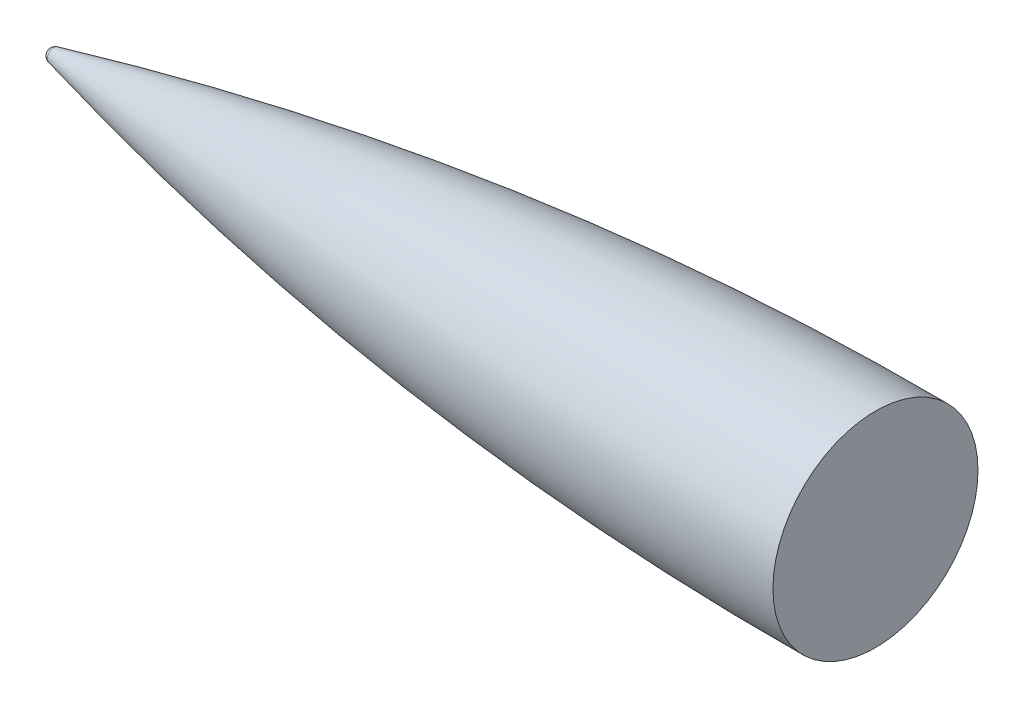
ISO-10303-21;
HEADER;
FILE_DESCRIPTION(('STEP AP214'),'2;1');
FILE_NAME('part.step','',(''),(''),'','','');
FILE_SCHEMA(('AUTOMOTIVE_DESIGN { 1 0 10303 214 1 1 1 1 }'));
ENDSEC;
DATA;
#1=APPLICATION_CONTEXT('core data for automotive mechanical design processes');
#2=APPLICATION_PROTOCOL_DEFINITION('international standard','automotive_design',2000,#1);
#3=PRODUCT_CONTEXT('',#1,'mechanical');
#4=PRODUCT('Part','Part','',(#3));
#5=PRODUCT_RELATED_PRODUCT_CATEGORY('part','',(#4));
#6=PRODUCT_DEFINITION_FORMATION('','',#4);
#7=PRODUCT_DEFINITION_CONTEXT('part definition',#1,'design');
#8=PRODUCT_DEFINITION('design','',#6,#7);
#9=PRODUCT_DEFINITION_SHAPE('','',#8);
#10=(LENGTH_UNIT() NAMED_UNIT(*) SI_UNIT(.MILLI.,.METRE.));
#11=(NAMED_UNIT(*) PLANE_ANGLE_UNIT() SI_UNIT($,.RADIAN.));
#12=(NAMED_UNIT(*) SI_UNIT($,.STERADIAN.) SOLID_ANGLE_UNIT());
#13=UNCERTAINTY_MEASURE_WITH_UNIT(LENGTH_MEASURE(1.E-05),#10,'distance_accuracy_value','');
#14=(GEOMETRIC_REPRESENTATION_CONTEXT(3) GLOBAL_UNCERTAINTY_ASSIGNED_CONTEXT((#13)) GLOBAL_UNIT_ASSIGNED_CONTEXT((#10,
#11,#12)) REPRESENTATION_CONTEXT('',''));
#15=CARTESIAN_POINT('',(0.,0.,0.));
#16=DIRECTION('',(0.,0.,1.));
#17=DIRECTION('',(1.,0.,0.));
#18=AXIS2_PLACEMENT_3D('',#15,#16,#17);
#19=CARTESIAN_POINT('',(325.525034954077,0.,0.));
#20=DIRECTION('',(1.,0.,0.));
#21=DIRECTION('',(0.,0.,-1.));
#22=AXIS2_PLACEMENT_3D('',#19,#20,#21);
#23=PLANE('',#22);
#24=CARTESIAN_POINT('',(325.525034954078,0.,0.));
#25=DIRECTION('',(1.,0.,0.));
#26=DIRECTION('',(0.,0.,-1.));
#27=AXIS2_PLACEMENT_3D('',#24,#25,#26);
#28=CIRCLE('',#27,39.37);
#29=CARTESIAN_POINT('',(325.525034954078,0.,-39.37));
#30=VERTEX_POINT('',#29);
#31=EDGE_CURVE('E10',#30,#30,#28,.T.);
#32=ORIENTED_EDGE('',*,*,#31,.T.);
#33=EDGE_LOOP('',(#32));
#34=FACE_BOUND('',#33,.T.);
#35=ADVANCED_FACE('F30',(#34),#23,.T.);
#36=CARTESIAN_POINT('',(317.693317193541,0.,0.));
#37=DIRECTION('',(1.,0.,0.));
#38=DIRECTION('',(0.,0.,-1.));
#39=AXIS2_PLACEMENT_3D('',#36,#37,#38);
#40=DEGENERATE_TOROIDAL_SURFACE('',#39,1261.33745347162,1300.73103112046,.F.);
#41=CARTESIAN_POINT('',(9.96412339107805,0.,0.));
#42=DIRECTION('',(1.,0.,0.));
#43=DIRECTION('',(0.,0.,-1.));
#44=AXIS2_PLACEMENT_3D('',#41,#42,#43);
#45=CIRCLE('',#44,2.46789491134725);
#46=CARTESIAN_POINT('',(9.96412339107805,0.,-2.46789491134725));
#47=VERTEX_POINT('',#46);
#48=EDGE_CURVE('E36',#47,#47,#45,.T.);
#49=ORIENTED_EDGE('',*,*,#48,.T.);
#50=EDGE_LOOP('',(#49));
#51=FACE_BOUND('',#50,.T.);
#52=ORIENTED_EDGE('',*,*,#31,.F.);
#53=EDGE_LOOP('',(#52));
#54=FACE_BOUND('',#53,.T.);
#55=ADVANCED_FACE('F42',(#51,#54),#40,.F.);
#56=CARTESIAN_POINT('',(10.5650349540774,0.,0.));
#57=DIRECTION('',(1.,0.,0.));
#58=DIRECTION('',(0.,1.,0.));
#59=AXIS2_PLACEMENT_3D('',#56,#57,#58);
#60=SPHERICAL_SURFACE('',#59,2.54);
#61=ORIENTED_EDGE('',*,*,#48,.F.);
#62=EDGE_LOOP('',(#61));
#63=FACE_BOUND('',#62,.T.);
#64=ADVANCED_FACE('F45',(#63),#60,.T.);
#65=CLOSED_SHELL('',(#35,#55,#64));
#66=MANIFOLD_SOLID_BREP('B2',#65);
#67=ADVANCED_BREP_SHAPE_REPRESENTATION('',(#18,#66),#14);
#68=SHAPE_DEFINITION_REPRESENTATION(#9,#67);
ENDSEC;
END-ISO-10303-21;
